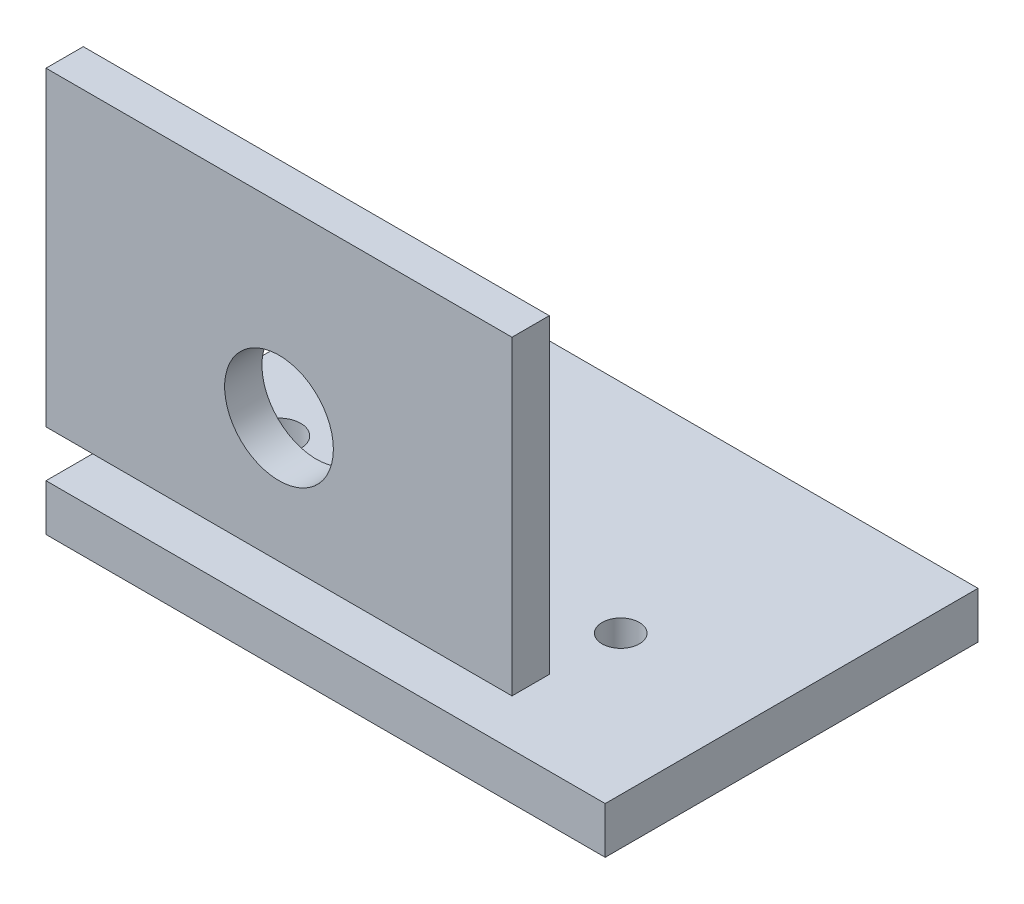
ISO-10303-21;
HEADER;
FILE_DESCRIPTION(('STEP AP214'),'2;1');
FILE_NAME('part.step','',(''),(''),'','','');
FILE_SCHEMA(('AUTOMOTIVE_DESIGN { 1 0 10303 214 1 1 1 1 }'));
ENDSEC;
DATA;
#1=APPLICATION_CONTEXT('core data for automotive mechanical design processes');
#2=APPLICATION_PROTOCOL_DEFINITION('international standard','automotive_design',2000,#1);
#3=PRODUCT_CONTEXT('',#1,'mechanical');
#4=PRODUCT('Part','Part','',(#3));
#5=PRODUCT_RELATED_PRODUCT_CATEGORY('part','',(#4));
#6=PRODUCT_DEFINITION_FORMATION('','',#4);
#7=PRODUCT_DEFINITION_CONTEXT('part definition',#1,'design');
#8=PRODUCT_DEFINITION('design','',#6,#7);
#9=PRODUCT_DEFINITION_SHAPE('','',#8);
#10=(LENGTH_UNIT() NAMED_UNIT(*) SI_UNIT(.MILLI.,.METRE.));
#11=(NAMED_UNIT(*) PLANE_ANGLE_UNIT() SI_UNIT($,.RADIAN.));
#12=(NAMED_UNIT(*) SI_UNIT($,.STERADIAN.) SOLID_ANGLE_UNIT());
#13=UNCERTAINTY_MEASURE_WITH_UNIT(LENGTH_MEASURE(1.E-05),#10,'distance_accuracy_value','');
#14=(GEOMETRIC_REPRESENTATION_CONTEXT(3) GLOBAL_UNCERTAINTY_ASSIGNED_CONTEXT((#13)) GLOBAL_UNIT_ASSIGNED_CONTEXT((#10,
#11,#12)) REPRESENTATION_CONTEXT('',''));
#15=CARTESIAN_POINT('',(0.,0.,0.));
#16=DIRECTION('',(0.,0.,1.));
#17=DIRECTION('',(1.,0.,0.));
#18=AXIS2_PLACEMENT_3D('',#15,#16,#17);
#19=CARTESIAN_POINT('',(0.,15.,-12.));
#20=DIRECTION('',(-1.,0.,0.));
#21=DIRECTION('',(0.,0.,1.));
#22=AXIS2_PLACEMENT_3D('',#19,#20,#21);
#23=PLANE('',#22);
#24=DIRECTION('',(0.,-1.,0.));
#25=VECTOR('',#24,1.);
#26=CARTESIAN_POINT('',(0.,15.,0.));
#27=LINE('',#26,#25);
#28=CARTESIAN_POINT('',(0.,115.,0.));
#29=VERTEX_POINT('',#28);
#30=CARTESIAN_POINT('',(0.,15.,0.));
#31=VERTEX_POINT('',#30);
#32=EDGE_CURVE('E117',#29,#31,#27,.T.);
#33=ORIENTED_EDGE('',*,*,#32,.F.);
#34=DIRECTION('',(0.,0.,1.));
#35=VECTOR('',#34,1.);
#36=CARTESIAN_POINT('',(0.,115.,-12.));
#37=LINE('',#36,#35);
#38=CARTESIAN_POINT('',(0.,115.,-12.));
#39=VERTEX_POINT('',#38);
#40=EDGE_CURVE('E12',#39,#29,#37,.T.);
#41=ORIENTED_EDGE('',*,*,#40,.F.);
#42=DIRECTION('',(0.,-1.,0.));
#43=VECTOR('',#42,1.);
#44=CARTESIAN_POINT('',(0.,15.,-12.));
#45=LINE('',#44,#43);
#46=CARTESIAN_POINT('',(0.,15.,-12.));
#47=VERTEX_POINT('',#46);
#48=EDGE_CURVE('E108',#39,#47,#45,.T.);
#49=ORIENTED_EDGE('',*,*,#48,.T.);
#50=DIRECTION('',(0.,0.,1.));
#51=VECTOR('',#50,1.);
#52=CARTESIAN_POINT('',(0.,15.,-12.));
#53=LINE('',#52,#51);
#54=EDGE_CURVE('E53',#47,#31,#53,.T.);
#55=ORIENTED_EDGE('',*,*,#54,.T.);
#56=EDGE_LOOP('',(#33,#41,#49,#55));
#57=FACE_BOUND('',#56,.T.);
#58=ADVANCED_FACE('F51',(#57),#23,.T.);
#59=CARTESIAN_POINT('',(0.,115.,-12.));
#60=DIRECTION('',(0.,1.,0.));
#61=DIRECTION('',(0.,0.,1.));
#62=AXIS2_PLACEMENT_3D('',#59,#60,#61);
#63=PLANE('',#62);
#64=DIRECTION('',(-1.,0.,0.));
#65=VECTOR('',#64,1.);
#66=CARTESIAN_POINT('',(0.,115.,0.));
#67=LINE('',#66,#65);
#68=CARTESIAN_POINT('',(150.,115.,0.));
#69=VERTEX_POINT('',#68);
#70=EDGE_CURVE('E112',#69,#29,#67,.T.);
#71=ORIENTED_EDGE('',*,*,#70,.F.);
#72=DIRECTION('',(0.,0.,1.));
#73=VECTOR('',#72,1.);
#74=CARTESIAN_POINT('',(150.,115.,-12.));
#75=LINE('',#74,#73);
#76=CARTESIAN_POINT('',(150.,115.,-12.));
#77=VERTEX_POINT('',#76);
#78=EDGE_CURVE('E58',#77,#69,#75,.T.);
#79=ORIENTED_EDGE('',*,*,#78,.F.);
#80=DIRECTION('',(-1.,0.,0.));
#81=VECTOR('',#80,1.);
#82=CARTESIAN_POINT('',(0.,115.,-12.));
#83=LINE('',#82,#81);
#84=EDGE_CURVE('E106',#77,#39,#83,.T.);
#85=ORIENTED_EDGE('',*,*,#84,.T.);
#86=ORIENTED_EDGE('',*,*,#40,.T.);
#87=EDGE_LOOP('',(#71,#79,#85,#86));
#88=FACE_BOUND('',#87,.T.);
#89=ADVANCED_FACE('F130',(#88),#63,.T.);
#90=CARTESIAN_POINT('',(150.,15.,-12.));
#91=DIRECTION('',(1.,0.,0.));
#92=DIRECTION('',(0.,0.,-1.));
#93=AXIS2_PLACEMENT_3D('',#90,#91,#92);
#94=PLANE('',#93);
#95=DIRECTION('',(0.,1.,0.));
#96=VECTOR('',#95,1.);
#97=CARTESIAN_POINT('',(150.,15.,0.));
#98=LINE('',#97,#96);
#99=CARTESIAN_POINT('',(150.,15.,0.));
#100=VERTEX_POINT('',#99);
#101=EDGE_CURVE('E101',#100,#69,#98,.T.);
#102=ORIENTED_EDGE('',*,*,#101,.F.);
#103=DIRECTION('',(0.,0.,1.));
#104=VECTOR('',#103,1.);
#105=CARTESIAN_POINT('',(150.,15.,-12.));
#106=LINE('',#105,#104);
#107=CARTESIAN_POINT('',(150.,15.,-12.));
#108=VERTEX_POINT('',#107);
#109=EDGE_CURVE('E96',#108,#100,#106,.T.);
#110=ORIENTED_EDGE('',*,*,#109,.F.);
#111=DIRECTION('',(0.,1.,0.));
#112=VECTOR('',#111,1.);
#113=CARTESIAN_POINT('',(150.,15.,-12.));
#114=LINE('',#113,#112);
#115=EDGE_CURVE('E97',#108,#77,#114,.T.);
#116=ORIENTED_EDGE('',*,*,#115,.T.);
#117=ORIENTED_EDGE('',*,*,#78,.T.);
#118=EDGE_LOOP('',(#102,#110,#116,#117));
#119=FACE_BOUND('',#118,.T.);
#120=ADVANCED_FACE('F98',(#119),#94,.T.);
#121=CARTESIAN_POINT('',(0.,15.,-12.));
#122=DIRECTION('',(0.,-1.,0.));
#123=DIRECTION('',(0.,0.,-1.));
#124=AXIS2_PLACEMENT_3D('',#121,#122,#123);
#125=PLANE('',#124);
#126=DIRECTION('',(1.,0.,0.));
#127=VECTOR('',#126,1.);
#128=CARTESIAN_POINT('',(0.,15.,0.));
#129=LINE('',#128,#127);
#130=EDGE_CURVE('E116',#31,#100,#129,.T.);
#131=ORIENTED_EDGE('',*,*,#130,.F.);
#132=ORIENTED_EDGE('',*,*,#54,.F.);
#133=DIRECTION('',(1.,0.,0.));
#134=VECTOR('',#133,1.);
#135=CARTESIAN_POINT('',(0.,15.,-12.));
#136=LINE('',#135,#134);
#137=EDGE_CURVE('E104',#47,#108,#136,.T.);
#138=ORIENTED_EDGE('',*,*,#137,.T.);
#139=ORIENTED_EDGE('',*,*,#109,.T.);
#140=EDGE_LOOP('',(#131,#132,#138,#139));
#141=FACE_BOUND('',#140,.T.);
#142=ADVANCED_FACE('F107',(#141),#125,.T.);
#143=CARTESIAN_POINT('',(0.,0.,-12.));
#144=DIRECTION('',(0.,0.,-1.));
#145=DIRECTION('',(-1.,0.,0.));
#146=AXIS2_PLACEMENT_3D('',#143,#144,#145);
#147=PLANE('',#146);
#148=CARTESIAN_POINT('',(75.,55.,-12.));
#149=DIRECTION('',(0.,0.,1.));
#150=DIRECTION('',(1.,0.,0.));
#151=AXIS2_PLACEMENT_3D('',#148,#149,#150);
#152=CIRCLE('',#151,17.5);
#153=CARTESIAN_POINT('',(92.5,55.,-12.));
#154=VERTEX_POINT('',#153);
#155=EDGE_CURVE('E118',#154,#154,#152,.T.);
#156=ORIENTED_EDGE('',*,*,#155,.T.);
#157=EDGE_LOOP('',(#156));
#158=FACE_BOUND('',#157,.T.);
#159=ORIENTED_EDGE('',*,*,#48,.F.);
#160=ORIENTED_EDGE('',*,*,#84,.F.);
#161=ORIENTED_EDGE('',*,*,#115,.F.);
#162=ORIENTED_EDGE('',*,*,#137,.F.);
#163=EDGE_LOOP('',(#159,#160,#161,#162));
#164=FACE_BOUND('',#163,.T.);
#165=ADVANCED_FACE('F102',(#158,#164),#147,.T.);
#166=CARTESIAN_POINT('',(0.,0.,0.));
#167=DIRECTION('',(0.,0.,-1.));
#168=DIRECTION('',(-1.,0.,0.));
#169=AXIS2_PLACEMENT_3D('',#166,#167,#168);
#170=PLANE('',#169);
#171=CARTESIAN_POINT('',(75.,55.,0.));
#172=DIRECTION('',(0.,0.,1.));
#173=DIRECTION('',(1.,0.,0.));
#174=AXIS2_PLACEMENT_3D('',#171,#172,#173);
#175=CIRCLE('',#174,17.5);
#176=CARTESIAN_POINT('',(92.5,55.,0.));
#177=VERTEX_POINT('',#176);
#178=EDGE_CURVE('E160',#177,#177,#175,.T.);
#179=ORIENTED_EDGE('',*,*,#178,.F.);
#180=EDGE_LOOP('',(#179));
#181=FACE_BOUND('',#180,.T.);
#182=ORIENTED_EDGE('',*,*,#32,.T.);
#183=ORIENTED_EDGE('',*,*,#130,.T.);
#184=ORIENTED_EDGE('',*,*,#101,.T.);
#185=ORIENTED_EDGE('',*,*,#70,.T.);
#186=EDGE_LOOP('',(#182,#183,#184,#185));
#187=FACE_BOUND('',#186,.T.);
#188=ADVANCED_FACE('F127',(#181,#187),#170,.F.);
#189=CARTESIAN_POINT('',(75.,55.,-12.));
#190=DIRECTION('',(0.,0.,1.));
#191=DIRECTION('',(1.,0.,0.));
#192=AXIS2_PLACEMENT_3D('',#189,#190,#191);
#193=CYLINDRICAL_SURFACE('',#192,17.5);
#194=ORIENTED_EDGE('',*,*,#155,.F.);
#195=EDGE_LOOP('',(#194));
#196=FACE_BOUND('',#195,.T.);
#197=ORIENTED_EDGE('',*,*,#178,.T.);
#198=EDGE_LOOP('',(#197));
#199=FACE_BOUND('',#198,.T.);
#200=ADVANCED_FACE('F144',(#196,#199),#193,.F.);
#201=CLOSED_SHELL('',(#58,#89,#120,#142,#165,#188,#200));
#202=MANIFOLD_SOLID_BREP('B2',#201);
#203=CARTESIAN_POINT('',(0.,-15.,0.));
#204=DIRECTION('',(-1.,0.,0.));
#205=DIRECTION('',(0.,0.,1.));
#206=AXIS2_PLACEMENT_3D('',#203,#204,#205);
#207=PLANE('',#206);
#208=DIRECTION('',(0.,0.,1.));
#209=VECTOR('',#208,1.);
#210=CARTESIAN_POINT('',(0.,0.,0.));
#211=LINE('',#210,#209);
#212=CARTESIAN_POINT('',(0.,0.,-120.));
#213=VERTEX_POINT('',#212);
#214=CARTESIAN_POINT('',(0.,0.,0.));
#215=VERTEX_POINT('',#214);
#216=EDGE_CURVE('E261',#213,#215,#211,.T.);
#217=ORIENTED_EDGE('',*,*,#216,.F.);
#218=DIRECTION('',(0.,1.,0.));
#219=VECTOR('',#218,1.);
#220=CARTESIAN_POINT('',(0.,-15.,-120.));
#221=LINE('',#220,#219);
#222=CARTESIAN_POINT('',(0.,-15.,-120.));
#223=VERTEX_POINT('',#222);
#224=EDGE_CURVE('E47',#223,#213,#221,.T.);
#225=ORIENTED_EDGE('',*,*,#224,.F.);
#226=DIRECTION('',(0.,0.,1.));
#227=VECTOR('',#226,1.);
#228=CARTESIAN_POINT('',(0.,-15.,0.));
#229=LINE('',#228,#227);
#230=CARTESIAN_POINT('',(0.,-15.,0.));
#231=VERTEX_POINT('',#230);
#232=EDGE_CURVE('E255',#223,#231,#229,.T.);
#233=ORIENTED_EDGE('',*,*,#232,.T.);
#234=DIRECTION('',(0.,1.,0.));
#235=VECTOR('',#234,1.);
#236=CARTESIAN_POINT('',(0.,-15.,0.));
#237=LINE('',#236,#235);
#238=EDGE_CURVE('E200',#231,#215,#237,.T.);
#239=ORIENTED_EDGE('',*,*,#238,.T.);
#240=EDGE_LOOP('',(#217,#225,#233,#239));
#241=FACE_BOUND('',#240,.T.);
#242=ADVANCED_FACE('F198',(#241),#207,.T.);
#243=CARTESIAN_POINT('',(0.,-15.,-120.));
#244=DIRECTION('',(0.,0.,-1.));
#245=DIRECTION('',(-1.,0.,0.));
#246=AXIS2_PLACEMENT_3D('',#243,#244,#245);
#247=PLANE('',#246);
#248=DIRECTION('',(-1.,0.,0.));
#249=VECTOR('',#248,1.);
#250=CARTESIAN_POINT('',(0.,0.,-120.));
#251=LINE('',#250,#249);
#252=CARTESIAN_POINT('',(180.,0.,-120.));
#253=VERTEX_POINT('',#252);
#254=EDGE_CURVE('E258',#253,#213,#251,.T.);
#255=ORIENTED_EDGE('',*,*,#254,.F.);
#256=DIRECTION('',(0.,1.,0.));
#257=VECTOR('',#256,1.);
#258=CARTESIAN_POINT('',(180.,-15.,-120.));
#259=LINE('',#258,#257);
#260=CARTESIAN_POINT('',(180.,-15.,-120.));
#261=VERTEX_POINT('',#260);
#262=EDGE_CURVE('E202',#261,#253,#259,.T.);
#263=ORIENTED_EDGE('',*,*,#262,.F.);
#264=DIRECTION('',(-1.,0.,0.));
#265=VECTOR('',#264,1.);
#266=CARTESIAN_POINT('',(0.,-15.,-120.));
#267=LINE('',#266,#265);
#268=EDGE_CURVE('E253',#261,#223,#267,.T.);
#269=ORIENTED_EDGE('',*,*,#268,.T.);
#270=ORIENTED_EDGE('',*,*,#224,.T.);
#271=EDGE_LOOP('',(#255,#263,#269,#270));
#272=FACE_BOUND('',#271,.T.);
#273=ADVANCED_FACE('F275',(#272),#247,.T.);
#274=CARTESIAN_POINT('',(180.,-15.,0.));
#275=DIRECTION('',(1.,0.,0.));
#276=DIRECTION('',(0.,0.,-1.));
#277=AXIS2_PLACEMENT_3D('',#274,#275,#276);
#278=PLANE('',#277);
#279=DIRECTION('',(0.,0.,-1.));
#280=VECTOR('',#279,1.);
#281=CARTESIAN_POINT('',(180.,0.,0.));
#282=LINE('',#281,#280);
#283=CARTESIAN_POINT('',(180.,0.,0.));
#284=VERTEX_POINT('',#283);
#285=EDGE_CURVE('E246',#284,#253,#282,.T.);
#286=ORIENTED_EDGE('',*,*,#285,.F.);
#287=DIRECTION('',(0.,1.,0.));
#288=VECTOR('',#287,1.);
#289=CARTESIAN_POINT('',(180.,-15.,0.));
#290=LINE('',#289,#288);
#291=CARTESIAN_POINT('',(180.,-15.,0.));
#292=VERTEX_POINT('',#291);
#293=EDGE_CURVE('E242',#292,#284,#290,.T.);
#294=ORIENTED_EDGE('',*,*,#293,.F.);
#295=DIRECTION('',(0.,0.,-1.));
#296=VECTOR('',#295,1.);
#297=CARTESIAN_POINT('',(180.,-15.,0.));
#298=LINE('',#297,#296);
#299=EDGE_CURVE('E241',#292,#261,#298,.T.);
#300=ORIENTED_EDGE('',*,*,#299,.T.);
#301=ORIENTED_EDGE('',*,*,#262,.T.);
#302=EDGE_LOOP('',(#286,#294,#300,#301));
#303=FACE_BOUND('',#302,.T.);
#304=ADVANCED_FACE('F245',(#303),#278,.T.);
#305=CARTESIAN_POINT('',(0.,-15.,0.));
#306=DIRECTION('',(0.,0.,1.));
#307=DIRECTION('',(1.,0.,0.));
#308=AXIS2_PLACEMENT_3D('',#305,#306,#307);
#309=PLANE('',#308);
#310=DIRECTION('',(1.,0.,0.));
#311=VECTOR('',#310,1.);
#312=CARTESIAN_POINT('',(0.,0.,0.));
#313=LINE('',#312,#311);
#314=EDGE_CURVE('E262',#215,#284,#313,.T.);
#315=ORIENTED_EDGE('',*,*,#314,.F.);
#316=ORIENTED_EDGE('',*,*,#238,.F.);
#317=DIRECTION('',(1.,0.,0.));
#318=VECTOR('',#317,1.);
#319=CARTESIAN_POINT('',(0.,-15.,0.));
#320=LINE('',#319,#318);
#321=EDGE_CURVE('E250',#231,#292,#320,.T.);
#322=ORIENTED_EDGE('',*,*,#321,.T.);
#323=ORIENTED_EDGE('',*,*,#293,.T.);
#324=EDGE_LOOP('',(#315,#316,#322,#323));
#325=FACE_BOUND('',#324,.T.);
#326=ADVANCED_FACE('F251',(#325),#309,.T.);
#327=CARTESIAN_POINT('',(0.,-15.,0.));
#328=DIRECTION('',(0.,-1.,0.));
#329=DIRECTION('',(0.,0.,-1.));
#330=AXIS2_PLACEMENT_3D('',#327,#328,#329);
#331=PLANE('',#330);
#332=CARTESIAN_POINT('',(25.,-15.,-50.));
#333=DIRECTION('',(0.,1.,0.));
#334=DIRECTION('',(0.,0.,1.));
#335=AXIS2_PLACEMENT_3D('',#332,#333,#334);
#336=CIRCLE('',#335,7.);
#337=CARTESIAN_POINT('',(25.,-15.,-43.));
#338=VERTEX_POINT('',#337);
#339=EDGE_CURVE('E264',#338,#338,#336,.T.);
#340=ORIENTED_EDGE('',*,*,#339,.T.);
#341=EDGE_LOOP('',(#340));
#342=FACE_BOUND('',#341,.T.);
#343=CARTESIAN_POINT('',(135.,-15.,-50.));
#344=DIRECTION('',(0.,1.,0.));
#345=DIRECTION('',(0.,0.,1.));
#346=AXIS2_PLACEMENT_3D('',#343,#344,#345);
#347=CIRCLE('',#346,6.00000000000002);
#348=CARTESIAN_POINT('',(135.,-15.,-44.));
#349=VERTEX_POINT('',#348);
#350=EDGE_CURVE('E315',#349,#349,#347,.T.);
#351=ORIENTED_EDGE('',*,*,#350,.T.);
#352=EDGE_LOOP('',(#351));
#353=FACE_BOUND('',#352,.T.);
#354=ORIENTED_EDGE('',*,*,#232,.F.);
#355=ORIENTED_EDGE('',*,*,#268,.F.);
#356=ORIENTED_EDGE('',*,*,#299,.F.);
#357=ORIENTED_EDGE('',*,*,#321,.F.);
#358=EDGE_LOOP('',(#354,#355,#356,#357));
#359=FACE_BOUND('',#358,.T.);
#360=ADVANCED_FACE('F248',(#342,#353,#359),#331,.T.);
#361=CARTESIAN_POINT('',(0.,0.,0.));
#362=DIRECTION('',(0.,-1.,0.));
#363=DIRECTION('',(0.,0.,-1.));
#364=AXIS2_PLACEMENT_3D('',#361,#362,#363);
#365=PLANE('',#364);
#366=CARTESIAN_POINT('',(25.,0.,-50.));
#367=DIRECTION('',(0.,1.,0.));
#368=DIRECTION('',(0.,0.,1.));
#369=AXIS2_PLACEMENT_3D('',#366,#367,#368);
#370=CIRCLE('',#369,7.);
#371=CARTESIAN_POINT('',(25.,0.,-43.));
#372=VERTEX_POINT('',#371);
#373=EDGE_CURVE('E307',#372,#372,#370,.T.);
#374=ORIENTED_EDGE('',*,*,#373,.F.);
#375=EDGE_LOOP('',(#374));
#376=FACE_BOUND('',#375,.T.);
#377=CARTESIAN_POINT('',(135.,0.,-50.));
#378=DIRECTION('',(0.,1.,0.));
#379=DIRECTION('',(0.,0.,1.));
#380=AXIS2_PLACEMENT_3D('',#377,#378,#379);
#381=CIRCLE('',#380,6.00000000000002);
#382=CARTESIAN_POINT('',(135.,0.,-44.));
#383=VERTEX_POINT('',#382);
#384=EDGE_CURVE('E306',#383,#383,#381,.T.);
#385=ORIENTED_EDGE('',*,*,#384,.F.);
#386=EDGE_LOOP('',(#385));
#387=FACE_BOUND('',#386,.T.);
#388=ORIENTED_EDGE('',*,*,#216,.T.);
#389=ORIENTED_EDGE('',*,*,#314,.T.);
#390=ORIENTED_EDGE('',*,*,#285,.T.);
#391=ORIENTED_EDGE('',*,*,#254,.T.);
#392=EDGE_LOOP('',(#388,#389,#390,#391));
#393=FACE_BOUND('',#392,.T.);
#394=ADVANCED_FACE('F271',(#376,#387,#393),#365,.F.);
#395=CARTESIAN_POINT('',(135.,-15.,-50.));
#396=DIRECTION('',(0.,1.,0.));
#397=DIRECTION('',(0.,0.,1.));
#398=AXIS2_PLACEMENT_3D('',#395,#396,#397);
#399=CYLINDRICAL_SURFACE('',#398,6.00000000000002);
#400=ORIENTED_EDGE('',*,*,#350,.F.);
#401=EDGE_LOOP('',(#400));
#402=FACE_BOUND('',#401,.T.);
#403=ORIENTED_EDGE('',*,*,#384,.T.);
#404=EDGE_LOOP('',(#403));
#405=FACE_BOUND('',#404,.T.);
#406=ADVANCED_FACE('F290',(#402,#405),#399,.F.);
#407=CARTESIAN_POINT('',(25.,-15.,-50.));
#408=DIRECTION('',(0.,1.,0.));
#409=DIRECTION('',(0.,0.,1.));
#410=AXIS2_PLACEMENT_3D('',#407,#408,#409);
#411=CYLINDRICAL_SURFACE('',#410,7.);
#412=ORIENTED_EDGE('',*,*,#339,.F.);
#413=EDGE_LOOP('',(#412));
#414=FACE_BOUND('',#413,.T.);
#415=ORIENTED_EDGE('',*,*,#373,.T.);
#416=EDGE_LOOP('',(#415));
#417=FACE_BOUND('',#416,.T.);
#418=ADVANCED_FACE('F299',(#414,#417),#411,.F.);
#419=CLOSED_SHELL('',(#242,#273,#304,#326,#360,#394,#406,#418));
#420=MANIFOLD_SOLID_BREP('B6',#419);
#421=ADVANCED_BREP_SHAPE_REPRESENTATION('',(#18,#202,#420),#14);
#422=SHAPE_DEFINITION_REPRESENTATION(#9,#421);
ENDSEC;
END-ISO-10303-21;
